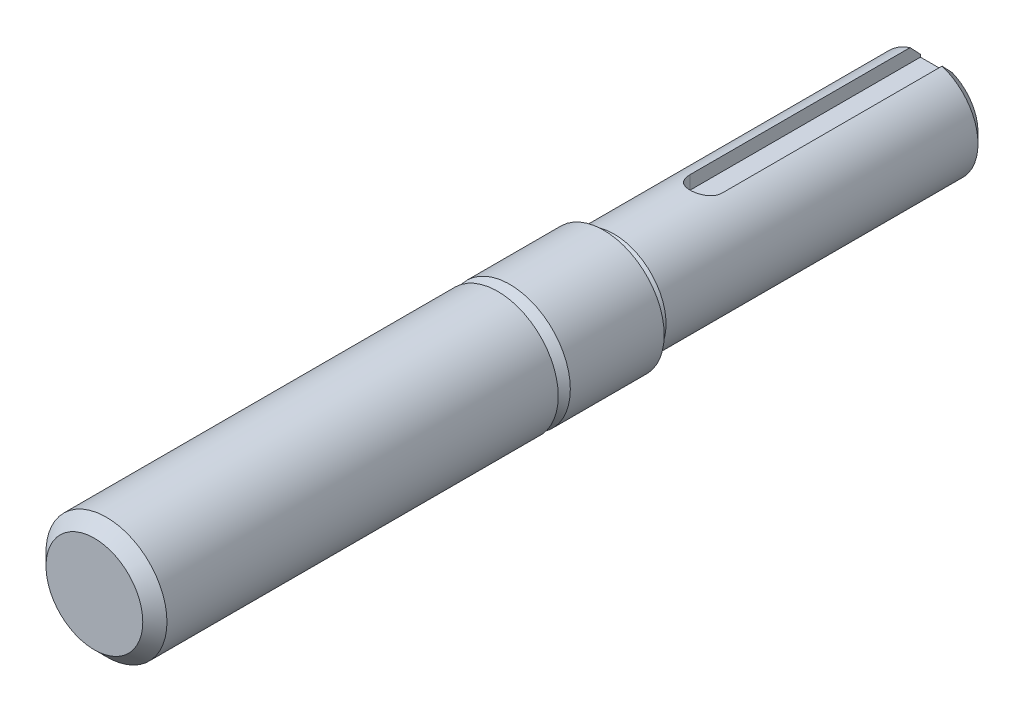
ISO-10303-21;
HEADER;
FILE_DESCRIPTION(('STEP AP214'),'2;1');
FILE_NAME('part.step','',(''),(''),'','','');
FILE_SCHEMA(('AUTOMOTIVE_DESIGN { 1 0 10303 214 1 1 1 1 }'));
ENDSEC;
DATA;
#1=APPLICATION_CONTEXT('core data for automotive mechanical design processes');
#2=APPLICATION_PROTOCOL_DEFINITION('international standard','automotive_design',2000,#1);
#3=PRODUCT_CONTEXT('',#1,'mechanical');
#4=PRODUCT('Part','Part','',(#3));
#5=PRODUCT_RELATED_PRODUCT_CATEGORY('part','',(#4));
#6=PRODUCT_DEFINITION_FORMATION('','',#4);
#7=PRODUCT_DEFINITION_CONTEXT('part definition',#1,'design');
#8=PRODUCT_DEFINITION('design','',#6,#7);
#9=PRODUCT_DEFINITION_SHAPE('','',#8);
#10=(LENGTH_UNIT() NAMED_UNIT(*) SI_UNIT(.MILLI.,.METRE.));
#11=(NAMED_UNIT(*) PLANE_ANGLE_UNIT() SI_UNIT($,.RADIAN.));
#12=(NAMED_UNIT(*) SI_UNIT($,.STERADIAN.) SOLID_ANGLE_UNIT());
#13=UNCERTAINTY_MEASURE_WITH_UNIT(LENGTH_MEASURE(1.E-05),#10,'distance_accuracy_value','');
#14=(GEOMETRIC_REPRESENTATION_CONTEXT(3) GLOBAL_UNCERTAINTY_ASSIGNED_CONTEXT((#13)) GLOBAL_UNIT_ASSIGNED_CONTEXT((#10,
#11,#12)) REPRESENTATION_CONTEXT('',''));
#15=CARTESIAN_POINT('',(0.,0.,0.));
#16=DIRECTION('',(0.,0.,1.));
#17=DIRECTION('',(1.,0.,0.));
#18=AXIS2_PLACEMENT_3D('',#15,#16,#17);
#19=CARTESIAN_POINT('',(0.,0.,0.));
#20=DIRECTION('',(0.,0.,-1.));
#21=DIRECTION('',(-1.,0.,0.));
#22=AXIS2_PLACEMENT_3D('',#19,#20,#21);
#23=PLANE('',#22);
#24=CARTESIAN_POINT('',(0.,0.,0.));
#25=DIRECTION('',(0.,0.,1.));
#26=DIRECTION('',(1.,0.,0.));
#27=AXIS2_PLACEMENT_3D('',#24,#25,#26);
#28=CIRCLE('',#27,4.801616);
#29=CARTESIAN_POINT('',(4.801616,0.,0.));
#30=VERTEX_POINT('',#29);
#31=EDGE_CURVE('E144',#30,#30,#28,.T.);
#32=ORIENTED_EDGE('',*,*,#31,.T.);
#33=EDGE_LOOP('',(#32));
#34=FACE_BOUND('',#33,.T.);
#35=ADVANCED_FACE('F31',(#34),#23,.F.);
#36=CARTESIAN_POINT('',(0.,0.,-1.200404));
#37=DIRECTION('',(0.,0.,-1.));
#38=DIRECTION('',(-1.,0.,0.));
#39=AXIS2_PLACEMENT_3D('',#36,#37,#38);
#40=CONICAL_SURFACE('',#39,6.00202,0.785398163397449);
#41=ORIENTED_EDGE('',*,*,#31,.F.);
#42=EDGE_LOOP('',(#41));
#43=FACE_BOUND('',#42,.T.);
#44=CARTESIAN_POINT('',(0.,0.,-1.200404));
#45=DIRECTION('',(0.,0.,1.));
#46=DIRECTION('',(1.,0.,0.));
#47=AXIS2_PLACEMENT_3D('',#44,#45,#46);
#48=CIRCLE('',#47,6.00202);
#49=CARTESIAN_POINT('',(6.00202,0.,-1.200404));
#50=VERTEX_POINT('',#49);
#51=EDGE_CURVE('E145',#50,#50,#48,.T.);
#52=ORIENTED_EDGE('',*,*,#51,.T.);
#53=EDGE_LOOP('',(#52));
#54=FACE_BOUND('',#53,.T.);
#55=ADVANCED_FACE('F135',(#43,#54),#40,.T.);
#56=CARTESIAN_POINT('',(0.,0.,0.));
#57=DIRECTION('',(0.,0.,1.));
#58=DIRECTION('',(1.,0.,0.));
#59=AXIS2_PLACEMENT_3D('',#56,#57,#58);
#60=CYLINDRICAL_SURFACE('',#59,6.00202);
#61=ORIENTED_EDGE('',*,*,#51,.F.);
#62=EDGE_LOOP('',(#61));
#63=FACE_BOUND('',#62,.T.);
#64=CARTESIAN_POINT('',(0.,0.,-40.0304));
#65=DIRECTION('',(0.,0.,1.));
#66=DIRECTION('',(1.,0.,0.));
#67=AXIS2_PLACEMENT_3D('',#64,#65,#66);
#68=CIRCLE('',#67,6.00202);
#69=CARTESIAN_POINT('',(6.00202,0.,-40.0304));
#70=VERTEX_POINT('',#69);
#71=EDGE_CURVE('E149',#70,#70,#68,.T.);
#72=ORIENTED_EDGE('',*,*,#71,.T.);
#73=EDGE_LOOP('',(#72));
#74=FACE_BOUND('',#73,.T.);
#75=ADVANCED_FACE('F140',(#63,#74),#60,.T.);
#76=CARTESIAN_POINT('',(0.,6.00202,-40.0304));
#77=DIRECTION('',(0.,0.,1.));
#78=DIRECTION('',(1.,0.,0.));
#79=AXIS2_PLACEMENT_3D('',#76,#77,#78);
#80=PLANE('',#79);
#81=ORIENTED_EDGE('',*,*,#71,.F.);
#82=EDGE_LOOP('',(#81));
#83=FACE_BOUND('',#82,.T.);
#84=CARTESIAN_POINT('',(0.,0.,-40.0304));
#85=DIRECTION('',(0.,0.,1.));
#86=DIRECTION('',(1.,0.,0.));
#87=AXIS2_PLACEMENT_3D('',#84,#85,#86);
#88=CIRCLE('',#87,4.801616);
#89=CARTESIAN_POINT('',(4.801616,0.,-40.0304));
#90=VERTEX_POINT('',#89);
#91=EDGE_CURVE('E278',#90,#90,#88,.T.);
#92=ORIENTED_EDGE('',*,*,#91,.T.);
#93=EDGE_LOOP('',(#92));
#94=FACE_BOUND('',#93,.T.);
#95=ADVANCED_FACE('F240',(#83,#94),#80,.F.);
#96=CARTESIAN_POINT('',(0.,0.,-41.230804));
#97=DIRECTION('',(0.,0.,-1.));
#98=DIRECTION('',(-1.,0.,0.));
#99=AXIS2_PLACEMENT_3D('',#96,#97,#98);
#100=CONICAL_SURFACE('',#99,6.00202,0.785398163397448);
#101=ORIENTED_EDGE('',*,*,#91,.F.);
#102=EDGE_LOOP('',(#101));
#103=FACE_BOUND('',#102,.T.);
#104=CARTESIAN_POINT('',(0.,0.,-41.230804));
#105=DIRECTION('',(0.,0.,1.));
#106=DIRECTION('',(1.,0.,0.));
#107=AXIS2_PLACEMENT_3D('',#104,#105,#106);
#108=CIRCLE('',#107,6.00202);
#109=CARTESIAN_POINT('',(6.00202,0.,-41.230804));
#110=VERTEX_POINT('',#109);
#111=EDGE_CURVE('E280',#110,#110,#108,.T.);
#112=ORIENTED_EDGE('',*,*,#111,.T.);
#113=EDGE_LOOP('',(#112));
#114=FACE_BOUND('',#113,.T.);
#115=ADVANCED_FACE('F230',(#103,#114),#100,.T.);
#116=CARTESIAN_POINT('',(0.,0.,0.));
#117=DIRECTION('',(0.,0.,1.));
#118=DIRECTION('',(1.,0.,0.));
#119=AXIS2_PLACEMENT_3D('',#116,#117,#118);
#120=CYLINDRICAL_SURFACE('',#119,6.00202);
#121=ORIENTED_EDGE('',*,*,#111,.F.);
#122=EDGE_LOOP('',(#121));
#123=FACE_BOUND('',#122,.T.);
#124=CARTESIAN_POINT('',(0.,0.,-50.546));
#125=DIRECTION('',(0.,0.,1.));
#126=DIRECTION('',(1.,0.,0.));
#127=AXIS2_PLACEMENT_3D('',#124,#125,#126);
#128=CIRCLE('',#127,6.00202);
#129=CARTESIAN_POINT('',(6.00202,0.,-50.546));
#130=VERTEX_POINT('',#129);
#131=EDGE_CURVE('E285',#130,#130,#128,.T.);
#132=ORIENTED_EDGE('',*,*,#131,.T.);
#133=EDGE_LOOP('',(#132));
#134=FACE_BOUND('',#133,.T.);
#135=ADVANCED_FACE('F220',(#123,#134),#120,.T.);
#136=CARTESIAN_POINT('',(0.,6.00202,-50.546));
#137=DIRECTION('',(0.,0.,1.));
#138=DIRECTION('',(1.,0.,0.));
#139=AXIS2_PLACEMENT_3D('',#136,#137,#138);
#140=PLANE('',#139);
#141=ORIENTED_EDGE('',*,*,#131,.F.);
#142=EDGE_LOOP('',(#141));
#143=FACE_BOUND('',#142,.T.);
#144=CARTESIAN_POINT('',(0.,0.,-50.546));
#145=DIRECTION('',(0.,0.,1.));
#146=DIRECTION('',(1.,0.,0.));
#147=AXIS2_PLACEMENT_3D('',#144,#145,#146);
#148=CIRCLE('',#147,4.64058);
#149=CARTESIAN_POINT('',(4.64058,0.,-50.546));
#150=VERTEX_POINT('',#149);
#151=EDGE_CURVE('E288',#150,#150,#148,.T.);
#152=ORIENTED_EDGE('',*,*,#151,.T.);
#153=EDGE_LOOP('',(#152));
#154=FACE_BOUND('',#153,.T.);
#155=ADVANCED_FACE('F210',(#143,#154),#140,.F.);
#156=CARTESIAN_POINT('',(0.,0.,-51.57724));
#157=DIRECTION('',(0.,0.,-1.));
#158=DIRECTION('',(-1.,0.,0.));
#159=AXIS2_PLACEMENT_3D('',#156,#157,#158);
#160=CONICAL_SURFACE('',#159,5.1562,0.463647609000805);
#161=ORIENTED_EDGE('',*,*,#151,.F.);
#162=EDGE_LOOP('',(#161));
#163=FACE_BOUND('',#162,.T.);
#164=CARTESIAN_POINT('',(0.,0.,-51.57724));
#165=DIRECTION('',(0.,0.,1.));
#166=DIRECTION('',(1.,0.,0.));
#167=AXIS2_PLACEMENT_3D('',#164,#165,#166);
#168=CIRCLE('',#167,5.1562);
#169=CARTESIAN_POINT('',(5.1562,0.,-51.57724));
#170=VERTEX_POINT('',#169);
#171=EDGE_CURVE('E291',#170,#170,#168,.T.);
#172=ORIENTED_EDGE('',*,*,#171,.T.);
#173=EDGE_LOOP('',(#172));
#174=FACE_BOUND('',#173,.T.);
#175=ADVANCED_FACE('F201',(#163,#174),#160,.T.);
#176=CARTESIAN_POINT('',(0.,0.,0.));
#177=DIRECTION('',(0.,0.,1.));
#178=DIRECTION('',(1.,0.,0.));
#179=AXIS2_PLACEMENT_3D('',#176,#177,#178);
#180=CYLINDRICAL_SURFACE('',#179,5.1562);
#181=ORIENTED_EDGE('',*,*,#171,.F.);
#182=EDGE_LOOP('',(#181));
#183=FACE_BOUND('',#182,.T.);
#184=CARTESIAN_POINT('',(1.5901005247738,4.90489334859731,-60.706));
#185=CARTESIAN_POINT('',(1.59010149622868,4.90488949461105,-60.6624812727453));
#186=CARTESIAN_POINT('',(1.58830988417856,4.90547421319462,-60.6189845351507));
#187=CARTESIAN_POINT('',(1.58117072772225,4.90778143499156,-60.5323243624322));
#188=CARTESIAN_POINT('',(1.57582402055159,4.90950367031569,-60.4891608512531));
#189=CARTESIAN_POINT('',(1.55454373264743,4.91630211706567,-60.3608740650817));
#190=CARTESIAN_POINT('',(1.53336950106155,4.92301061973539,-60.2766451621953));
#191=CARTESIAN_POINT('',(1.47778386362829,4.93997823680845,-60.1131632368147));
#192=CARTESIAN_POINT('',(1.44337772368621,4.9502359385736,-60.0339082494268));
#193=CARTESIAN_POINT('',(1.36236584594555,4.97314034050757,-59.8822352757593));
#194=CARTESIAN_POINT('',(1.31575399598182,4.98578823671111,-59.809820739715));
#195=CARTESIAN_POINT('',(1.21000173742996,5.01251931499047,-59.6715224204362));
#196=CARTESIAN_POINT('',(1.15052622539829,5.02663425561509,-59.6059010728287));
#197=CARTESIAN_POINT('',(1.02144883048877,5.05444297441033,-59.4853845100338));
#198=CARTESIAN_POINT('',(0.951845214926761,5.06813668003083,-59.4304911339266));
#199=CARTESIAN_POINT('',(0.802593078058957,5.09392720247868,-59.3318300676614));
#200=CARTESIAN_POINT('',(0.722756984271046,5.10598217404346,-59.2883342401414));
#201=CARTESIAN_POINT('',(0.556471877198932,5.12676756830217,-59.2154913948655));
#202=CARTESIAN_POINT('',(0.470024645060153,5.13549888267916,-59.1861405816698));
#203=CARTESIAN_POINT('',(0.29571936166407,5.14843212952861,-59.1432944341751));
#204=CARTESIAN_POINT('',(0.20798138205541,5.1527620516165,-59.1293499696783));
#205=CARTESIAN_POINT('',(0.031309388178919,5.15686130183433,-59.1162913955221));
#206=CARTESIAN_POINT('',(-0.057624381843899,5.15663154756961,-59.1171743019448));
#207=CARTESIAN_POINT('',(-0.23098952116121,5.15172933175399,-59.1334484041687));
#208=CARTESIAN_POINT('',(-0.315471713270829,5.14720657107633,-59.1483505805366));
#209=CARTESIAN_POINT('',(-0.48067229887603,5.13441530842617,-59.1914399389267));
#210=CARTESIAN_POINT('',(-0.56139049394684,5.12614660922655,-59.2196278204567));
#211=CARTESIAN_POINT('',(-0.717898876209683,5.10659561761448,-59.2888036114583));
#212=CARTESIAN_POINT('',(-0.79361898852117,5.09527863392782,-59.3299398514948));
#213=CARTESIAN_POINT('',(-0.937234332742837,5.07082880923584,-59.4237260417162));
#214=CARTESIAN_POINT('',(-1.00512771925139,5.05769554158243,-59.4763786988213));
#215=CARTESIAN_POINT('',(-1.13405954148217,5.03039044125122,-59.5942038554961));
#216=CARTESIAN_POINT('',(-1.19471071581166,5.01619808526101,-59.6597958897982));
#217=CARTESIAN_POINT('',(-1.3042781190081,4.98883307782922,-59.8003695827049));
#218=CARTESIAN_POINT('',(-1.35319085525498,4.97566073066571,-59.8753540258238));
#219=CARTESIAN_POINT('',(-1.4383373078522,4.95172385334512,-60.0336716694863));
#220=CARTESIAN_POINT('',(-1.47442344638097,4.94098783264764,-60.1170886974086));
#221=CARTESIAN_POINT('',(-1.53187487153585,4.92348195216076,-60.2891794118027));
#222=CARTESIAN_POINT('',(-1.55326277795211,4.91670600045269,-60.3778447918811));
#223=CARTESIAN_POINT('',(-1.57290038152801,4.91043926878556,-60.5071231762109));
#224=CARTESIAN_POINT('',(-1.57739923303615,4.90899410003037,-60.5467793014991));
#225=CARTESIAN_POINT('',(-1.58339624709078,4.90706242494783,-60.6262834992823));
#226=CARTESIAN_POINT('',(-1.58489871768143,4.90657454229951,-60.6661312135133));
#227=CARTESIAN_POINT('',(-1.5848994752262,4.90657641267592,-60.706));
#228=B_SPLINE_CURVE_WITH_KNOTS('',3,(#184,#185,#186,#187,#188,#189,#190,#191,#192,#193,#194,
#195,#196,#197,#198,#199,#200,#201,#202,#203,#204,#205,#206,#207,#208,#209,#210,#211,#212,#213,
#214,#215,#216,#217,#218,#219,#220,#221,#222,#223,#224,#225,#226,#227),.UNSPECIFIED.,.F.,.F.,(4,
2,2,2,2,2,2,2,2,2,2,2,2,2,2,2,2,2,2,2,2,4),(0.,0.130472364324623,0.260914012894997,
0.520881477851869,0.780745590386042,1.04074008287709,1.30856641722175,1.57643862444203,
1.8502144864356,2.12391684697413,2.38941043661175,2.65485059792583,2.91136205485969,
3.16788701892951,3.42746467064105,3.68710340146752,3.95722119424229,4.22741925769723,
4.50063249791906,4.77342433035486,4.89313007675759,5.01266359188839),.UNSPECIFIED.);
#229=CARTESIAN_POINT('',(1.5901005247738,4.90489334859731,-60.706));
#230=VERTEX_POINT('',#229);
#231=CARTESIAN_POINT('',(-1.5848994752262,4.90657641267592,-60.706));
#232=VERTEX_POINT('',#231);
#233=EDGE_CURVE('E11',#230,#232,#228,.T.);
#234=ORIENTED_EDGE('',*,*,#233,.T.);
#235=DIRECTION('',(0.,0.,1.));
#236=VECTOR('',#235,1.);
#237=CARTESIAN_POINT('',(-1.58489947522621,4.90657641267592,0.));
#238=LINE('',#237,#236);
#239=CARTESIAN_POINT('',(-1.5848994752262,4.90657641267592,-82.53476));
#240=VERTEX_POINT('',#239);
#241=EDGE_CURVE('E158',#232,#240,#238,.F.);
#242=ORIENTED_EDGE('',*,*,#241,.T.);
#243=CARTESIAN_POINT('',(0.,0.,-82.53476));
#244=DIRECTION('',(0.,0.,1.));
#245=DIRECTION('',(1.,0.,0.));
#246=AXIS2_PLACEMENT_3D('',#243,#244,#245);
#247=CIRCLE('',#246,5.1562);
#248=CARTESIAN_POINT('',(1.5901005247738,4.90489334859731,-82.53476));
#249=VERTEX_POINT('',#248);
#250=EDGE_CURVE('E157',#240,#249,#247,.T.);
#251=ORIENTED_EDGE('',*,*,#250,.T.);
#252=DIRECTION('',(0.,0.,1.));
#253=VECTOR('',#252,1.);
#254=CARTESIAN_POINT('',(1.59010052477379,4.90489334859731,0.));
#255=LINE('',#254,#253);
#256=EDGE_CURVE('E114',#249,#230,#255,.T.);
#257=ORIENTED_EDGE('',*,*,#256,.T.);
#258=EDGE_LOOP('',(#234,#242,#251,#257));
#259=FACE_BOUND('',#258,.T.);
#260=ADVANCED_FACE('F131',(#183,#259),#180,.T.);
#261=CARTESIAN_POINT('',(0.,0.,-83.566));
#262=DIRECTION('',(0.,0.,1.));
#263=DIRECTION('',(1.,0.,0.));
#264=AXIS2_PLACEMENT_3D('',#261,#262,#263);
#265=CONICAL_SURFACE('',#264,4.12496,0.785398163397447);
#266=ORIENTED_EDGE('',*,*,#250,.F.);
#267=CARTESIAN_POINT('',(-1.5848994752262,6.56838154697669,-80.9340714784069));
#268=CARTESIAN_POINT('',(-1.5848994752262,6.34888531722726,-81.1474033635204));
#269=CARTESIAN_POINT('',(-1.5848994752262,6.12913198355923,-81.3604732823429));
#270=CARTESIAN_POINT('',(-1.5848994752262,5.68888888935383,-81.7857104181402));
#271=CARTESIAN_POINT('',(-1.5848994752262,5.46839938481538,-81.9978779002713));
#272=CARTESIAN_POINT('',(-1.5848994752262,5.02668946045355,-82.4207161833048));
#273=CARTESIAN_POINT('',(-1.5848994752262,4.8054708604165,-82.631388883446));
#274=CARTESIAN_POINT('',(-1.5848994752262,4.36136745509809,-83.0511213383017));
#275=CARTESIAN_POINT('',(-1.5848994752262,4.13848213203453,-83.2601805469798));
#276=CARTESIAN_POINT('',(-1.5848994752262,3.80197349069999,-83.5720818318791));
#277=CARTESIAN_POINT('',(-1.5848994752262,3.68927315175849,-83.675919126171));
#278=CARTESIAN_POINT('',(-1.5848994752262,3.46307977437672,-83.8827165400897));
#279=CARTESIAN_POINT('',(-1.5848994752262,3.34958677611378,-83.9856767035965));
#280=CARTESIAN_POINT('',(-1.5848994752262,3.12166090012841,-84.1903657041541));
#281=CARTESIAN_POINT('',(-1.5848994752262,3.00722886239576,-84.2920954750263));
#282=CARTESIAN_POINT('',(-1.5848994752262,2.77697520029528,-84.4940196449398));
#283=CARTESIAN_POINT('',(-1.5848994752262,2.66115331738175,-84.5942137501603));
#284=CARTESIAN_POINT('',(-1.5848994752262,2.42731604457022,-84.792696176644));
#285=CARTESIAN_POINT('',(-1.5848994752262,2.30929535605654,-84.8909782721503));
#286=CARTESIAN_POINT('',(-1.5848994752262,2.07069135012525,-85.0842875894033));
#287=CARTESIAN_POINT('',(-1.5848994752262,1.95010940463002,-85.1793164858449));
#288=CARTESIAN_POINT('',(-1.5848994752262,1.7662082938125,-85.3182404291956));
#289=CARTESIAN_POINT('',(-1.5848994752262,1.70430860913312,-85.364010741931));
#290=CARTESIAN_POINT('',(-1.5848994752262,1.57934820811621,-85.4539167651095));
#291=CARTESIAN_POINT('',(-1.5848994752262,1.51628772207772,-85.4980527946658));
#292=CARTESIAN_POINT('',(-1.5848994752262,1.38862756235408,-85.5843139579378));
#293=CARTESIAN_POINT('',(-1.5848994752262,1.32402534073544,-85.6264353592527));
#294=CARTESIAN_POINT('',(-1.5848994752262,1.19302221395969,-85.7078737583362));
#295=CARTESIAN_POINT('',(-1.5848994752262,1.12662010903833,-85.747188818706));
#296=CARTESIAN_POINT('',(-1.5848994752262,1.05917775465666,-85.7847166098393));
#297=B_SPLINE_CURVE_WITH_KNOTS('',3,(#267,#268,#269,#270,#271,#272,#273,#274,#275,#276,#277,
#278,#279,#280,#281,#282,#283,#284,#285,#286,#287,#288,#289,#290,#291,#292,#293,#294,#295,#296),
.UNSPECIFIED.,.F.,.F.,(4,2,2,2,2,2,2,2,2,2,2,2,2,2,4),(0.,0.918262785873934,1.83623399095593,
2.7526820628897,3.66942775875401,4.12915475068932,4.58885860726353,5.04818837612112,
5.5076049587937,5.96832725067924,6.42880869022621,6.65973946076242,6.89062489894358,
7.12192271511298,7.35337869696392),.UNSPECIFIED.);
#298=CARTESIAN_POINT('',(-1.5848994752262,3.8083314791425,-83.566));
#299=VERTEX_POINT('',#298);
#300=EDGE_CURVE('E58',#240,#299,#297,.T.);
#301=ORIENTED_EDGE('',*,*,#300,.T.);
#302=CARTESIAN_POINT('',(0.,0.,-83.566));
#303=DIRECTION('',(0.,0.,1.));
#304=DIRECTION('',(1.,0.,0.));
#305=AXIS2_PLACEMENT_3D('',#302,#303,#304);
#306=CIRCLE('',#305,4.12496);
#307=CARTESIAN_POINT('',(1.5901005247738,3.80616280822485,-83.566));
#308=VERTEX_POINT('',#307);
#309=EDGE_CURVE('E154',#299,#308,#306,.T.);
#310=ORIENTED_EDGE('',*,*,#309,.T.);
#311=CARTESIAN_POINT('',(1.5901005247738,1.0565383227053,-85.7818521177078));
#312=CARTESIAN_POINT('',(1.5901005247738,1.09795555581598,-85.7589240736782));
#313=CARTESIAN_POINT('',(1.5901005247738,1.13897548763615,-85.7352954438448));
#314=CARTESIAN_POINT('',(1.5901005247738,1.22029362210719,-85.6868481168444));
#315=CARTESIAN_POINT('',(1.5901005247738,1.26059200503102,-85.6620297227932));
#316=CARTESIAN_POINT('',(1.5901005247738,1.38046810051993,-85.5861371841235));
#317=CARTESIAN_POINT('',(1.5901005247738,1.45910631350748,-85.5335806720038));
#318=CARTESIAN_POINT('',(1.5901005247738,1.61423907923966,-85.4257687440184));
#319=CARTESIAN_POINT('',(1.5901005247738,1.6907378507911,-85.3705193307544));
#320=CARTESIAN_POINT('',(1.5901005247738,1.84221344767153,-85.2579362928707));
#321=CARTESIAN_POINT('',(1.5901005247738,1.91718983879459,-85.200602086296));
#322=CARTESIAN_POINT('',(1.5901005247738,2.06569012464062,-85.0845531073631));
#323=CARTESIAN_POINT('',(1.5901005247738,2.13921778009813,-85.0258431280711));
#324=CARTESIAN_POINT('',(1.5901005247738,2.285289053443,-84.907229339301));
#325=CARTESIAN_POINT('',(1.5901005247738,2.35783276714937,-84.8473256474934));
#326=CARTESIAN_POINT('',(1.5901005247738,2.57437383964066,-84.6661422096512));
#327=CARTESIAN_POINT('',(1.5901005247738,2.71719545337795,-84.5434580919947));
#328=CARTESIAN_POINT('',(1.5901005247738,2.94809121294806,-84.3416584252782));
#329=CARTESIAN_POINT('',(1.5901005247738,3.03680966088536,-84.2632735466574));
#330=CARTESIAN_POINT('',(1.5901005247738,3.21354922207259,-84.1057536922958));
#331=CARTESIAN_POINT('',(1.5901005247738,3.3015704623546,-84.0266188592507));
#332=CARTESIAN_POINT('',(1.5901005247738,3.4771419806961,-83.8676699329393));
#333=CARTESIAN_POINT('',(1.5901005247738,3.56469175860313,-83.7878552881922));
#334=CARTESIAN_POINT('',(1.5901005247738,3.73934082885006,-83.6277248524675));
#335=CARTESIAN_POINT('',(1.5901005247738,3.82644009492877,-83.5474090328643));
#336=CARTESIAN_POINT('',(1.5901005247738,4.13794109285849,-83.2588308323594));
#337=CARTESIAN_POINT('',(1.5901005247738,4.36128420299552,-83.0494260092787));
#338=CARTESIAN_POINT('',(1.5901005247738,4.80635982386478,-82.6289185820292));
#339=CARTESIAN_POINT('',(1.5901005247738,5.02809233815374,-82.4178159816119));
#340=CARTESIAN_POINT('',(1.5901005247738,5.46992832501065,-81.9949601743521));
#341=CARTESIAN_POINT('',(1.5901005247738,5.69003441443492,-81.7832096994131));
#342=CARTESIAN_POINT('',(1.5901005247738,6.12943298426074,-81.3588782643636));
#343=CARTESIAN_POINT('',(1.5901005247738,6.3487254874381,-81.1462973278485));
#344=CARTESIAN_POINT('',(1.5901005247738,6.56776011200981,-80.9334536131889));
#345=B_SPLINE_CURVE_WITH_KNOTS('',3,(#311,#312,#313,#314,#315,#316,#317,#318,#319,#320,#321,
#322,#323,#324,#325,#326,#327,#328,#329,#330,#331,#332,#333,#334,#335,#336,#337,#338,#339,#340,
#341,#342,#343,#344),.UNSPECIFIED.,.F.,.F.,(4,2,2,2,2,2,2,2,2,2,2,2,2,2,2,2,4),(0.,
0.14200085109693,0.283965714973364,0.567621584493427,0.850671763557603,1.13380156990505,
1.41605982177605,1.69829038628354,2.26307952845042,2.61823383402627,2.97332186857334,
3.32873229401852,3.68416320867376,4.60261923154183,5.52107322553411,6.43734813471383,
7.35359719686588),.UNSPECIFIED.);
#346=EDGE_CURVE('E105',#308,#249,#345,.T.);
#347=ORIENTED_EDGE('',*,*,#346,.T.);
#348=EDGE_LOOP('',(#266,#301,#310,#347));
#349=FACE_BOUND('',#348,.T.);
#350=ADVANCED_FACE('F116',(#349),#265,.T.);
#351=CARTESIAN_POINT('',(0.,4.12496,-83.566));
#352=DIRECTION('',(0.,0.,1.));
#353=DIRECTION('',(1.,0.,0.));
#354=AXIS2_PLACEMENT_3D('',#351,#352,#353);
#355=PLANE('',#354);
#356=ORIENTED_EDGE('',*,*,#309,.F.);
#357=DIRECTION('',(0.,-1.,0.));
#358=VECTOR('',#357,1.);
#359=CARTESIAN_POINT('',(-1.5848994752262,4.12496,-83.566));
#360=LINE('',#359,#358);
#361=CARTESIAN_POINT('',(-1.5848994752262,3.5687,-83.566));
#362=VERTEX_POINT('',#361);
#363=EDGE_CURVE('E43',#299,#362,#360,.T.);
#364=ORIENTED_EDGE('',*,*,#363,.T.);
#365=DIRECTION('',(1.,0.,0.));
#366=VECTOR('',#365,1.);
#367=CARTESIAN_POINT('',(-1.5848994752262,3.5687,-83.566));
#368=LINE('',#367,#366);
#369=CARTESIAN_POINT('',(1.5901005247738,3.5687,-83.566));
#370=VERTEX_POINT('',#369);
#371=EDGE_CURVE('E100',#362,#370,#368,.T.);
#372=ORIENTED_EDGE('',*,*,#371,.T.);
#373=DIRECTION('',(0.,1.,0.));
#374=VECTOR('',#373,1.);
#375=CARTESIAN_POINT('',(1.5901005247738,4.12496,-83.566));
#376=LINE('',#375,#374);
#377=EDGE_CURVE('E98',#370,#308,#376,.T.);
#378=ORIENTED_EDGE('',*,*,#377,.T.);
#379=EDGE_LOOP('',(#356,#364,#372,#378));
#380=FACE_BOUND('',#379,.T.);
#381=ADVANCED_FACE('F124',(#380),#355,.F.);
#382=CARTESIAN_POINT('',(0.00260052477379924,6.00202000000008,-60.706));
#383=DIRECTION('',(0.,-1.,0.));
#384=DIRECTION('',(0.,0.,-1.));
#385=AXIS2_PLACEMENT_3D('',#382,#383,#384);
#386=CYLINDRICAL_SURFACE('',#385,1.5875);
#387=DIRECTION('',(0.,-1.,0.));
#388=VECTOR('',#387,1.);
#389=CARTESIAN_POINT('',(1.5901005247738,6.00202000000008,-60.706));
#390=LINE('',#389,#388);
#391=CARTESIAN_POINT('',(1.5901005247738,3.56870000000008,-60.706));
#392=VERTEX_POINT('',#391);
#393=EDGE_CURVE('E83',#230,#392,#390,.T.);
#394=ORIENTED_EDGE('',*,*,#393,.T.);
#395=CARTESIAN_POINT('',(0.00260052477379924,3.56870000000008,-60.706));
#396=DIRECTION('',(0.,-1.,0.));
#397=DIRECTION('',(0.,0.,-1.));
#398=AXIS2_PLACEMENT_3D('',#395,#396,#397);
#399=CIRCLE('',#398,1.5875);
#400=CARTESIAN_POINT('',(-1.5848994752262,3.56870000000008,-60.706));
#401=VERTEX_POINT('',#400);
#402=EDGE_CURVE('E86',#392,#401,#399,.T.);
#403=ORIENTED_EDGE('',*,*,#402,.T.);
#404=DIRECTION('',(0.,-1.,0.));
#405=VECTOR('',#404,1.);
#406=CARTESIAN_POINT('',(-1.5848994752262,6.00202000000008,-60.706));
#407=LINE('',#406,#405);
#408=EDGE_CURVE('E90',#232,#401,#407,.T.);
#409=ORIENTED_EDGE('',*,*,#408,.F.);
#410=ORIENTED_EDGE('',*,*,#233,.F.);
#411=EDGE_LOOP('',(#394,#403,#409,#410));
#412=FACE_BOUND('',#411,.T.);
#413=ADVANCED_FACE('F84',(#412),#386,.F.);
#414=CARTESIAN_POINT('',(-1.5848994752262,6.00202000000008,-60.706));
#415=DIRECTION('',(-1.,0.,0.));
#416=DIRECTION('',(0.,0.,1.));
#417=AXIS2_PLACEMENT_3D('',#414,#415,#416);
#418=PLANE('',#417);
#419=ORIENTED_EDGE('',*,*,#408,.T.);
#420=DIRECTION('',(0.,0.,-1.));
#421=VECTOR('',#420,1.);
#422=CARTESIAN_POINT('',(-1.5848994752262,3.56870000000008,-60.706));
#423=LINE('',#422,#421);
#424=EDGE_CURVE('E91',#401,#362,#423,.T.);
#425=ORIENTED_EDGE('',*,*,#424,.T.);
#426=ORIENTED_EDGE('',*,*,#363,.F.);
#427=ORIENTED_EDGE('',*,*,#300,.F.);
#428=ORIENTED_EDGE('',*,*,#241,.F.);
#429=EDGE_LOOP('',(#419,#425,#426,#427,#428));
#430=FACE_BOUND('',#429,.T.);
#431=ADVANCED_FACE('F121',(#430),#418,.F.);
#432=CARTESIAN_POINT('',(1.5901005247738,6.00202,-83.566));
#433=DIRECTION('',(1.,0.,0.));
#434=DIRECTION('',(0.,0.,-1.));
#435=AXIS2_PLACEMENT_3D('',#432,#433,#434);
#436=PLANE('',#435);
#437=ORIENTED_EDGE('',*,*,#346,.F.);
#438=ORIENTED_EDGE('',*,*,#377,.F.);
#439=DIRECTION('',(0.,0.,1.));
#440=VECTOR('',#439,1.);
#441=CARTESIAN_POINT('',(1.5901005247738,3.5687,-83.566));
#442=LINE('',#441,#440);
#443=EDGE_CURVE('E50',#370,#392,#442,.T.);
#444=ORIENTED_EDGE('',*,*,#443,.T.);
#445=ORIENTED_EDGE('',*,*,#393,.F.);
#446=ORIENTED_EDGE('',*,*,#256,.F.);
#447=EDGE_LOOP('',(#437,#438,#444,#445,#446));
#448=FACE_BOUND('',#447,.T.);
#449=ADVANCED_FACE('F96',(#448),#436,.F.);
#450=CARTESIAN_POINT('',(0.00260052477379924,3.56870000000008,-60.706));
#451=DIRECTION('',(0.,-1.,0.));
#452=DIRECTION('',(0.,0.,-1.));
#453=AXIS2_PLACEMENT_3D('',#450,#451,#452);
#454=PLANE('',#453);
#455=ORIENTED_EDGE('',*,*,#371,.F.);
#456=ORIENTED_EDGE('',*,*,#424,.F.);
#457=ORIENTED_EDGE('',*,*,#402,.F.);
#458=ORIENTED_EDGE('',*,*,#443,.F.);
#459=EDGE_LOOP('',(#455,#456,#457,#458));
#460=FACE_BOUND('',#459,.T.);
#461=ADVANCED_FACE('F93',(#460),#454,.F.);
#462=CLOSED_SHELL('',(#35,#55,#75,#95,#115,#135,#155,#175,#260,#350,#381,#413,#431,#449,#461));
#463=MANIFOLD_SOLID_BREP('B2',#462);
#464=ADVANCED_BREP_SHAPE_REPRESENTATION('',(#18,#463),#14);
#465=SHAPE_DEFINITION_REPRESENTATION(#9,#464);
ENDSEC;
END-ISO-10303-21;
